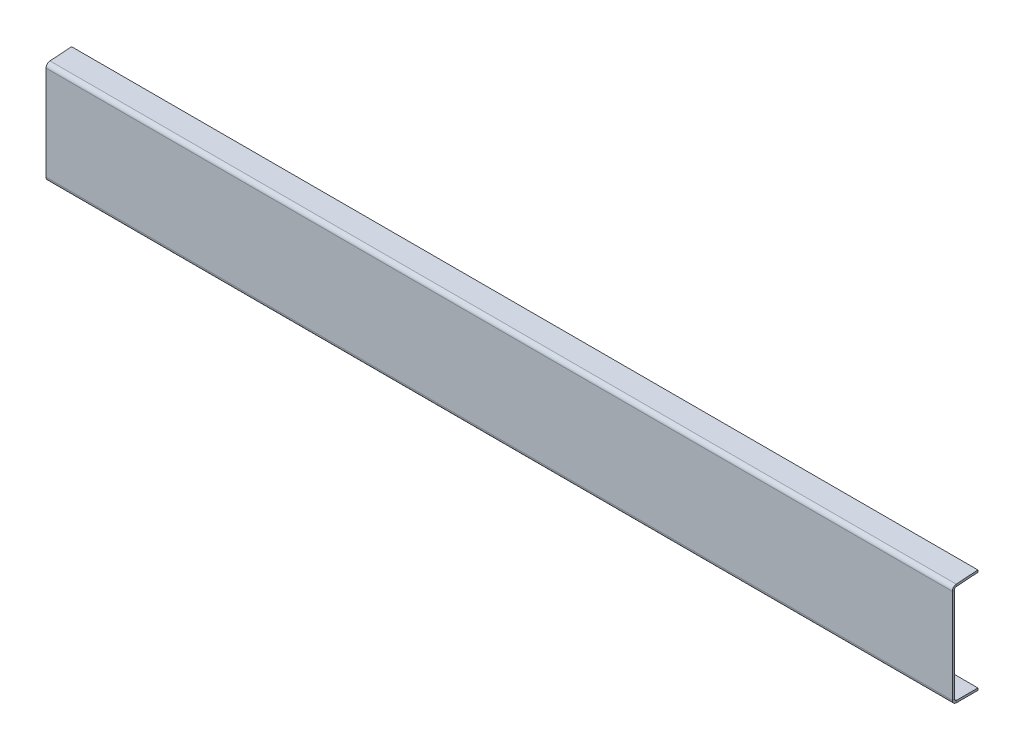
ISO-10303-21;
HEADER;
FILE_DESCRIPTION(('STEP AP214'),'2;1');
FILE_NAME('part.step','',(''),(''),'','','');
FILE_SCHEMA(('AUTOMOTIVE_DESIGN { 1 0 10303 214 1 1 1 1 }'));
ENDSEC;
DATA;
#1=APPLICATION_CONTEXT('core data for automotive mechanical design processes');
#2=APPLICATION_PROTOCOL_DEFINITION('international standard','automotive_design',2000,#1);
#3=PRODUCT_CONTEXT('',#1,'mechanical');
#4=PRODUCT('Part','Part','',(#3));
#5=PRODUCT_RELATED_PRODUCT_CATEGORY('part','',(#4));
#6=PRODUCT_DEFINITION_FORMATION('','',#4);
#7=PRODUCT_DEFINITION_CONTEXT('part definition',#1,'design');
#8=PRODUCT_DEFINITION('design','',#6,#7);
#9=PRODUCT_DEFINITION_SHAPE('','',#8);
#10=(LENGTH_UNIT() NAMED_UNIT(*) SI_UNIT(.MILLI.,.METRE.));
#11=(NAMED_UNIT(*) PLANE_ANGLE_UNIT() SI_UNIT($,.RADIAN.));
#12=(NAMED_UNIT(*) SI_UNIT($,.STERADIAN.) SOLID_ANGLE_UNIT());
#13=UNCERTAINTY_MEASURE_WITH_UNIT(LENGTH_MEASURE(1.E-05),#10,'distance_accuracy_value','');
#14=(GEOMETRIC_REPRESENTATION_CONTEXT(3) GLOBAL_UNCERTAINTY_ASSIGNED_CONTEXT((#13)) GLOBAL_UNIT_ASSIGNED_CONTEXT((#10,
#11,#12)) REPRESENTATION_CONTEXT('',''));
#15=CARTESIAN_POINT('',(0.,0.,0.));
#16=DIRECTION('',(0.,0.,1.));
#17=DIRECTION('',(1.,0.,0.));
#18=AXIS2_PLACEMENT_3D('',#15,#16,#17);
#19=CARTESIAN_POINT('',(2692.4,12.6999999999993,7.99360577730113E-12));
#20=DIRECTION('',(1.,0.,0.));
#21=DIRECTION('',(0.,0.,-0.999999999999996));
#22=AXIS2_PLACEMENT_3D('',#19,#20,#21);
#23=PLANE('',#22);
#24=DIRECTION('',(0.,0.,-0.999999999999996));
#25=VECTOR('',#24,1.);
#26=CARTESIAN_POINT('',(2692.4,12.6999999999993,7.99360577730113E-12));
#27=LINE('',#26,#25);
#28=CARTESIAN_POINT('',(2692.4,12.6999999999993,7.99360577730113E-12));
#29=VERTEX_POINT('',#28);
#30=CARTESIAN_POINT('',(2692.4,12.6999999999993,-6.34999999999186));
#31=VERTEX_POINT('',#30);
#32=EDGE_CURVE('E11',#29,#31,#27,.T.);
#33=ORIENTED_EDGE('',*,*,#32,.F.);
#34=CARTESIAN_POINT('',(2692.4,12.6999999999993,-12.6999999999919));
#35=DIRECTION('',(1.,0.,0.));
#36=DIRECTION('',(0.,0.,-0.999999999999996));
#37=AXIS2_PLACEMENT_3D('',#34,#35,#36);
#38=CIRCLE('',#37,12.7);
#39=CARTESIAN_POINT('',(2692.4,-6.7028581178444E-13,-12.6999999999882));
#40=VERTEX_POINT('',#39);
#41=EDGE_CURVE('E246',#40,#29,#38,.F.);
#42=ORIENTED_EDGE('',*,*,#41,.F.);
#43=DIRECTION('',(0.,-1.,0.));
#44=VECTOR('',#43,1.);
#45=CARTESIAN_POINT('',(2692.4,6.34999999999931,-12.6999999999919));
#46=LINE('',#45,#44);
#47=CARTESIAN_POINT('',(2692.4,6.34999999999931,-12.6999999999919));
#48=VERTEX_POINT('',#47);
#49=EDGE_CURVE('E44',#48,#40,#46,.T.);
#50=ORIENTED_EDGE('',*,*,#49,.F.);
#51=CARTESIAN_POINT('',(2692.4,12.6999999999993,-12.6999999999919));
#52=DIRECTION('',(1.,0.,0.));
#53=DIRECTION('',(0.,0.,-0.999999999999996));
#54=AXIS2_PLACEMENT_3D('',#51,#52,#53);
#55=CIRCLE('',#54,6.35);
#56=EDGE_CURVE('E145',#48,#31,#55,.F.);
#57=ORIENTED_EDGE('',*,*,#56,.T.);
#58=EDGE_LOOP('',(#33,#42,#50,#57));
#59=FACE_BOUND('',#58,.T.);
#60=ADVANCED_FACE('F36',(#59),#23,.T.);
#61=CARTESIAN_POINT('',(2692.4,6.34999999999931,-12.6999999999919));
#62=DIRECTION('',(1.,0.,0.));
#63=DIRECTION('',(0.,0.,-0.999999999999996));
#64=AXIS2_PLACEMENT_3D('',#61,#62,#63);
#65=PLANE('',#64);
#66=DIRECTION('',(0.,1.,0.));
#67=VECTOR('',#66,1.);
#68=CARTESIAN_POINT('',(2692.4,-6.72562006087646E-13,1.19904086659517E-11));
#69=LINE('',#68,#67);
#70=CARTESIAN_POINT('',(2692.4,292.957058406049,7.99360577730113E-12));
#71=VERTEX_POINT('',#70);
#72=EDGE_CURVE('E139',#29,#71,#69,.T.);
#73=ORIENTED_EDGE('',*,*,#72,.F.);
#74=ORIENTED_EDGE('',*,*,#32,.T.);
#75=DIRECTION('',(0.,1.,0.));
#76=VECTOR('',#75,1.);
#77=CARTESIAN_POINT('',(2692.4,-6.71768890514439E-13,-6.34999999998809));
#78=LINE('',#77,#76);
#79=CARTESIAN_POINT('',(2692.4,292.957058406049,-6.34999999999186));
#80=VERTEX_POINT('',#79);
#81=EDGE_CURVE('E136',#31,#80,#78,.T.);
#82=ORIENTED_EDGE('',*,*,#81,.T.);
#83=DIRECTION('',(0.,0.,0.999999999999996));
#84=VECTOR('',#83,1.);
#85=CARTESIAN_POINT('',(2692.4,292.957058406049,-6.34999999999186));
#86=LINE('',#85,#84);
#87=EDGE_CURVE('E227',#80,#71,#86,.T.);
#88=ORIENTED_EDGE('',*,*,#87,.T.);
#89=EDGE_LOOP('',(#73,#74,#82,#88));
#90=FACE_BOUND('',#89,.T.);
#91=ADVANCED_FACE('F134',(#90),#65,.T.);
#92=CARTESIAN_POINT('',(0.,0.,-12.7000000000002));
#93=DIRECTION('',(-1.,0.,0.));
#94=DIRECTION('',(0.,0.,0.999999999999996));
#95=AXIS2_PLACEMENT_3D('',#92,#93,#94);
#96=PLANE('',#95);
#97=DIRECTION('',(0.,1.,0.));
#98=VECTOR('',#97,1.);
#99=CARTESIAN_POINT('',(0.,0.,-12.7000000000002));
#100=LINE('',#99,#98);
#101=CARTESIAN_POINT('',(0.,0.,-12.7000000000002));
#102=VERTEX_POINT('',#101);
#103=CARTESIAN_POINT('',(0.,6.34999999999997,-12.7000000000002));
#104=VERTEX_POINT('',#103);
#105=EDGE_CURVE('E232',#102,#104,#100,.T.);
#106=ORIENTED_EDGE('',*,*,#105,.F.);
#107=CARTESIAN_POINT('',(0.,12.7,-12.7000000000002));
#108=DIRECTION('',(1.,0.,0.));
#109=DIRECTION('',(0.,0.,-0.999999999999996));
#110=AXIS2_PLACEMENT_3D('',#107,#108,#109);
#111=CIRCLE('',#110,12.7);
#112=CARTESIAN_POINT('',(0.,12.7,0.));
#113=VERTEX_POINT('',#112);
#114=EDGE_CURVE('E184',#102,#113,#111,.F.);
#115=ORIENTED_EDGE('',*,*,#114,.T.);
#116=DIRECTION('',(0.,0.,0.999999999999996));
#117=VECTOR('',#116,1.);
#118=CARTESIAN_POINT('',(0.,12.7,-6.35000000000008));
#119=LINE('',#118,#117);
#120=CARTESIAN_POINT('',(0.,12.7,-6.35000000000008));
#121=VERTEX_POINT('',#120);
#122=EDGE_CURVE('E230',#121,#113,#119,.T.);
#123=ORIENTED_EDGE('',*,*,#122,.F.);
#124=CARTESIAN_POINT('',(0.,12.7,-12.7000000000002));
#125=DIRECTION('',(1.,0.,0.));
#126=DIRECTION('',(0.,0.,-0.999999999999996));
#127=AXIS2_PLACEMENT_3D('',#124,#125,#126);
#128=CIRCLE('',#127,6.35);
#129=EDGE_CURVE('E157',#104,#121,#128,.F.);
#130=ORIENTED_EDGE('',*,*,#129,.F.);
#131=EDGE_LOOP('',(#106,#115,#123,#130));
#132=FACE_BOUND('',#131,.T.);
#133=ADVANCED_FACE('F284',(#132),#96,.T.);
#134=CARTESIAN_POINT('',(0.,12.7,-6.35000000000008));
#135=DIRECTION('',(-1.,0.,0.));
#136=DIRECTION('',(0.,0.,0.999999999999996));
#137=AXIS2_PLACEMENT_3D('',#134,#135,#136);
#138=PLANE('',#137);
#139=DIRECTION('',(0.,0.,0.999999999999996));
#140=VECTOR('',#139,1.);
#141=CARTESIAN_POINT('',(0.,0.,-76.2));
#142=LINE('',#141,#140);
#143=CARTESIAN_POINT('',(0.,0.,-76.2));
#144=VERTEX_POINT('',#143);
#145=EDGE_CURVE('E187',#144,#102,#142,.T.);
#146=ORIENTED_EDGE('',*,*,#145,.T.);
#147=ORIENTED_EDGE('',*,*,#105,.T.);
#148=DIRECTION('',(0.,0.,0.999999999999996));
#149=VECTOR('',#148,1.);
#150=CARTESIAN_POINT('',(0.,6.35,-76.2));
#151=LINE('',#150,#149);
#152=CARTESIAN_POINT('',(0.,6.35,-76.2));
#153=VERTEX_POINT('',#152);
#154=EDGE_CURVE('E193',#153,#104,#151,.T.);
#155=ORIENTED_EDGE('',*,*,#154,.F.);
#156=DIRECTION('',(0.,-1.,0.));
#157=VECTOR('',#156,1.);
#158=CARTESIAN_POINT('',(0.,6.35,-76.2));
#159=LINE('',#158,#157);
#160=EDGE_CURVE('E190',#153,#144,#159,.T.);
#161=ORIENTED_EDGE('',*,*,#160,.T.);
#162=EDGE_LOOP('',(#146,#147,#155,#161));
#163=FACE_BOUND('',#162,.T.);
#164=ADVANCED_FACE('F287',(#163),#138,.T.);
#165=CARTESIAN_POINT('',(2692.4,305.626121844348,-11.8140927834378));
#166=DIRECTION('',(1.,0.,0.));
#167=DIRECTION('',(0.,0.,-0.999999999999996));
#168=AXIS2_PLACEMENT_3D('',#165,#166,#167);
#169=PLANE('',#168);
#170=DIRECTION('',(0.,-0.997564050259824,-0.0697564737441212));
#171=VECTOR('',#170,1.);
#172=CARTESIAN_POINT('',(2692.4,305.626121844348,-11.8140927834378));
#173=LINE('',#172,#171);
#174=CARTESIAN_POINT('',(2692.4,305.626121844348,-11.8140927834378));
#175=VERTEX_POINT('',#174);
#176=CARTESIAN_POINT('',(2692.4,299.291590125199,-12.2570463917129));
#177=VERTEX_POINT('',#176);
#178=EDGE_CURVE('E52',#175,#177,#173,.T.);
#179=ORIENTED_EDGE('',*,*,#178,.F.);
#180=CARTESIAN_POINT('',(2692.4,292.95705840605,-12.6999999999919));
#181=DIRECTION('',(1.,0.,0.));
#182=DIRECTION('',(0.,0.,-0.999999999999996));
#183=AXIS2_PLACEMENT_3D('',#180,#181,#182);
#184=CIRCLE('',#183,12.7);
#185=EDGE_CURVE('E256',#71,#175,#184,.F.);
#186=ORIENTED_EDGE('',*,*,#185,.F.);
#187=ORIENTED_EDGE('',*,*,#87,.F.);
#188=CARTESIAN_POINT('',(2692.4,292.95705840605,-12.6999999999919));
#189=DIRECTION('',(1.,0.,0.));
#190=DIRECTION('',(0.,0.,-0.999999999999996));
#191=AXIS2_PLACEMENT_3D('',#188,#189,#190);
#192=CIRCLE('',#191,6.35);
#193=EDGE_CURVE('E165',#80,#177,#192,.F.);
#194=ORIENTED_EDGE('',*,*,#193,.T.);
#195=EDGE_LOOP('',(#179,#186,#187,#194));
#196=FACE_BOUND('',#195,.T.);
#197=ADVANCED_FACE('F279',(#196),#169,.T.);
#198=CARTESIAN_POINT('',(2692.4,292.957058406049,-6.34999999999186));
#199=DIRECTION('',(1.,0.,0.));
#200=DIRECTION('',(0.,0.,-0.999999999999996));
#201=AXIS2_PLACEMENT_3D('',#198,#199,#200);
#202=PLANE('',#201);
#203=DIRECTION('',(0.,0.0697564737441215,-0.997564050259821));
#204=VECTOR('',#203,1.);
#205=CARTESIAN_POINT('',(2692.4,304.799999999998,1.19904086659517E-11));
#206=LINE('',#205,#204);
#207=CARTESIAN_POINT('',(2692.4,310.115443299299,-76.0143806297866));
#208=VERTEX_POINT('',#207);
#209=EDGE_CURVE('E259',#175,#208,#206,.T.);
#210=ORIENTED_EDGE('',*,*,#209,.F.);
#211=ORIENTED_EDGE('',*,*,#178,.T.);
#212=DIRECTION('',(0.,0.0697564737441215,-0.997564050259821));
#213=VECTOR('',#212,1.);
#214=CARTESIAN_POINT('',(2692.4,298.465468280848,-0.442953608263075));
#215=LINE('',#214,#213);
#216=CARTESIAN_POINT('',(2692.4,303.78091158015,-76.4573342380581));
#217=VERTEX_POINT('',#216);
#218=EDGE_CURVE('E106',#177,#217,#215,.T.);
#219=ORIENTED_EDGE('',*,*,#218,.T.);
#220=DIRECTION('',(0.,-0.997564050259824,-0.0697564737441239));
#221=VECTOR('',#220,1.);
#222=CARTESIAN_POINT('',(2692.4,310.115443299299,-76.0143806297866));
#223=LINE('',#222,#221);
#224=EDGE_CURVE('E262',#208,#217,#223,.T.);
#225=ORIENTED_EDGE('',*,*,#224,.F.);
#226=EDGE_LOOP('',(#210,#211,#219,#225));
#227=FACE_BOUND('',#226,.T.);
#228=ADVANCED_FACE('F268',(#227),#202,.T.);
#229=CARTESIAN_POINT('',(0.,292.957058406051,0.));
#230=DIRECTION('',(-1.,0.,0.));
#231=DIRECTION('',(0.,0.,0.999999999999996));
#232=AXIS2_PLACEMENT_3D('',#229,#230,#231);
#233=PLANE('',#232);
#234=DIRECTION('',(0.,0.,-0.999999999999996));
#235=VECTOR('',#234,1.);
#236=CARTESIAN_POINT('',(0.,292.957058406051,0.));
#237=LINE('',#236,#235);
#238=CARTESIAN_POINT('',(0.,292.957058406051,0.));
#239=VERTEX_POINT('',#238);
#240=CARTESIAN_POINT('',(0.,292.957058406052,-6.35000000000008));
#241=VERTEX_POINT('',#240);
#242=EDGE_CURVE('E93',#239,#241,#237,.T.);
#243=ORIENTED_EDGE('',*,*,#242,.F.);
#244=CARTESIAN_POINT('',(0.,292.957058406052,-12.7000000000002));
#245=DIRECTION('',(1.,0.,0.));
#246=DIRECTION('',(0.,0.,-0.999999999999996));
#247=AXIS2_PLACEMENT_3D('',#244,#245,#246);
#248=CIRCLE('',#247,12.7);
#249=CARTESIAN_POINT('',(0.,305.62612184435,-11.8140927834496));
#250=VERTEX_POINT('',#249);
#251=EDGE_CURVE('E180',#239,#250,#248,.F.);
#252=ORIENTED_EDGE('',*,*,#251,.T.);
#253=DIRECTION('',(0.,0.997564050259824,0.0697564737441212));
#254=VECTOR('',#253,1.);
#255=CARTESIAN_POINT('',(0.,299.291590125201,-12.2570463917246));
#256=LINE('',#255,#254);
#257=CARTESIAN_POINT('',(0.,299.291590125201,-12.2570463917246));
#258=VERTEX_POINT('',#257);
#259=EDGE_CURVE('E100',#258,#250,#256,.T.);
#260=ORIENTED_EDGE('',*,*,#259,.F.);
#261=CARTESIAN_POINT('',(0.,292.957058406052,-12.7000000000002));
#262=DIRECTION('',(1.,0.,0.));
#263=DIRECTION('',(0.,0.,-0.999999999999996));
#264=AXIS2_PLACEMENT_3D('',#261,#262,#263);
#265=CIRCLE('',#264,6.35);
#266=EDGE_CURVE('E199',#241,#258,#265,.F.);
#267=ORIENTED_EDGE('',*,*,#266,.F.);
#268=EDGE_LOOP('',(#243,#252,#260,#267));
#269=FACE_BOUND('',#268,.T.);
#270=ADVANCED_FACE('F316',(#269),#233,.T.);
#271=CARTESIAN_POINT('',(0.,299.291590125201,-12.2570463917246));
#272=DIRECTION('',(-1.,0.,0.));
#273=DIRECTION('',(0.,0.,0.999999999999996));
#274=AXIS2_PLACEMENT_3D('',#271,#272,#273);
#275=PLANE('',#274);
#276=DIRECTION('',(0.,1.,0.));
#277=VECTOR('',#276,1.);
#278=CARTESIAN_POINT('',(0.,0.,0.));
#279=LINE('',#278,#277);
#280=EDGE_CURVE('E182',#113,#239,#279,.T.);
#281=ORIENTED_EDGE('',*,*,#280,.T.);
#282=ORIENTED_EDGE('',*,*,#242,.T.);
#283=DIRECTION('',(0.,1.,0.));
#284=VECTOR('',#283,1.);
#285=CARTESIAN_POINT('',(0.,0.,-6.35000000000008));
#286=LINE('',#285,#284);
#287=EDGE_CURVE('E197',#121,#241,#286,.T.);
#288=ORIENTED_EDGE('',*,*,#287,.F.);
#289=ORIENTED_EDGE('',*,*,#122,.T.);
#290=EDGE_LOOP('',(#281,#282,#288,#289));
#291=FACE_BOUND('',#290,.T.);
#292=ADVANCED_FACE('F319',(#291),#275,.T.);
#293=CARTESIAN_POINT('',(2692.4,298.465468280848,-0.442953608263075));
#294=DIRECTION('',(0.,0.997564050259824,0.069756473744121));
#295=DIRECTION('',(0.,-0.0697564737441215,0.997564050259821));
#296=AXIS2_PLACEMENT_3D('',#293,#294,#295);
#297=PLANE('',#296);
#298=DIRECTION('',(0.,0.0697564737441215,-0.997564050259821));
#299=VECTOR('',#298,1.);
#300=CARTESIAN_POINT('',(0.,298.46546828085,-0.442953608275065));
#301=LINE('',#300,#299);
#302=CARTESIAN_POINT('',(0.,303.780911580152,-76.4573342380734));
#303=VERTEX_POINT('',#302);
#304=EDGE_CURVE('E171',#258,#303,#301,.T.);
#305=ORIENTED_EDGE('',*,*,#304,.T.);
#306=DIRECTION('',(-1.,0.,0.));
#307=VECTOR('',#306,1.);
#308=CARTESIAN_POINT('',(2692.4,303.78091158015,-76.4573342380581));
#309=LINE('',#308,#307);
#310=EDGE_CURVE('E223',#217,#303,#309,.T.);
#311=ORIENTED_EDGE('',*,*,#310,.F.);
#312=ORIENTED_EDGE('',*,*,#218,.F.);
#313=DIRECTION('',(-1.,0.,0.));
#314=VECTOR('',#313,1.);
#315=CARTESIAN_POINT('',(2692.4,299.291590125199,-12.2570463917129));
#316=LINE('',#315,#314);
#317=EDGE_CURVE('E167',#177,#258,#316,.T.);
#318=ORIENTED_EDGE('',*,*,#317,.T.);
#319=EDGE_LOOP('',(#305,#311,#312,#318));
#320=FACE_BOUND('',#319,.T.);
#321=ADVANCED_FACE('F322',(#320),#297,.F.);
#322=CARTESIAN_POINT('',(2692.4,310.115443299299,-76.0143806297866));
#323=DIRECTION('',(0.,0.0697564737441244,-0.99756405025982));
#324=DIRECTION('',(0.,0.997564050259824,0.0697564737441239));
#325=AXIS2_PLACEMENT_3D('',#322,#323,#324);
#326=PLANE('',#325);
#327=DIRECTION('',(0.,-0.997564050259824,-0.0697564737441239));
#328=VECTOR('',#327,1.);
#329=CARTESIAN_POINT('',(0.,310.115443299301,-76.0143806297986));
#330=LINE('',#329,#328);
#331=CARTESIAN_POINT('',(0.,310.115443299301,-76.0143806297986));
#332=VERTEX_POINT('',#331);
#333=EDGE_CURVE('E174',#332,#303,#330,.T.);
#334=ORIENTED_EDGE('',*,*,#333,.F.);
#335=DIRECTION('',(-1.,0.,0.));
#336=VECTOR('',#335,1.);
#337=CARTESIAN_POINT('',(2692.4,310.115443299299,-76.0143806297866));
#338=LINE('',#337,#336);
#339=EDGE_CURVE('E221',#208,#332,#338,.T.);
#340=ORIENTED_EDGE('',*,*,#339,.F.);
#341=ORIENTED_EDGE('',*,*,#224,.T.);
#342=ORIENTED_EDGE('',*,*,#310,.T.);
#343=EDGE_LOOP('',(#334,#340,#341,#342));
#344=FACE_BOUND('',#343,.T.);
#345=ADVANCED_FACE('F267',(#344),#326,.T.);
#346=CARTESIAN_POINT('',(2692.4,304.799999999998,1.19904086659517E-11));
#347=DIRECTION('',(0.,0.997564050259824,0.069756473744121));
#348=DIRECTION('',(0.,-0.0697564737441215,0.997564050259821));
#349=AXIS2_PLACEMENT_3D('',#346,#347,#348);
#350=PLANE('',#349);
#351=DIRECTION('',(0.,0.0697564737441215,-0.997564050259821));
#352=VECTOR('',#351,1.);
#353=CARTESIAN_POINT('',(0.,304.8,0.));
#354=LINE('',#353,#352);
#355=EDGE_CURVE('E177',#250,#332,#354,.T.);
#356=ORIENTED_EDGE('',*,*,#355,.F.);
#357=DIRECTION('',(-1.,0.,0.));
#358=VECTOR('',#357,1.);
#359=CARTESIAN_POINT('',(2692.4,305.626121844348,-11.8140927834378));
#360=LINE('',#359,#358);
#361=EDGE_CURVE('E218',#175,#250,#360,.T.);
#362=ORIENTED_EDGE('',*,*,#361,.F.);
#363=ORIENTED_EDGE('',*,*,#209,.T.);
#364=ORIENTED_EDGE('',*,*,#339,.T.);
#365=EDGE_LOOP('',(#356,#362,#363,#364));
#366=FACE_BOUND('',#365,.T.);
#367=ADVANCED_FACE('F272',(#366),#350,.T.);
#368=CARTESIAN_POINT('',(2692.4,292.95705840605,-12.6999999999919));
#369=DIRECTION('',(-1.,0.,0.));
#370=DIRECTION('',(0.,0.,0.999999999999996));
#371=AXIS2_PLACEMENT_3D('',#368,#369,#370);
#372=CYLINDRICAL_SURFACE('',#371,12.7);
#373=ORIENTED_EDGE('',*,*,#251,.F.);
#374=DIRECTION('',(-1.,0.,0.));
#375=VECTOR('',#374,1.);
#376=CARTESIAN_POINT('',(2692.4,292.957058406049,7.99360577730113E-12));
#377=LINE('',#376,#375);
#378=EDGE_CURVE('E215',#71,#239,#377,.T.);
#379=ORIENTED_EDGE('',*,*,#378,.F.);
#380=ORIENTED_EDGE('',*,*,#185,.T.);
#381=ORIENTED_EDGE('',*,*,#361,.T.);
#382=EDGE_LOOP('',(#373,#379,#380,#381));
#383=FACE_BOUND('',#382,.T.);
#384=ADVANCED_FACE('F275',(#383),#372,.T.);
#385=CARTESIAN_POINT('',(2692.4,-6.72562006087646E-13,1.19904086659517E-11));
#386=DIRECTION('',(0.,0.,0.999999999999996));
#387=DIRECTION('',(1.,0.,0.));
#388=AXIS2_PLACEMENT_3D('',#385,#386,#387);
#389=PLANE('',#388);
#390=ORIENTED_EDGE('',*,*,#280,.F.);
#391=DIRECTION('',(-1.,0.,0.));
#392=VECTOR('',#391,1.);
#393=CARTESIAN_POINT('',(2692.4,12.6999999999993,7.99360577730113E-12));
#394=LINE('',#393,#392);
#395=EDGE_CURVE('E212',#29,#113,#394,.T.);
#396=ORIENTED_EDGE('',*,*,#395,.F.);
#397=ORIENTED_EDGE('',*,*,#72,.T.);
#398=ORIENTED_EDGE('',*,*,#378,.T.);
#399=EDGE_LOOP('',(#390,#396,#397,#398));
#400=FACE_BOUND('',#399,.T.);
#401=ADVANCED_FACE('F282',(#400),#389,.T.);
#402=CARTESIAN_POINT('',(2692.4,12.6999999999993,-12.6999999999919));
#403=DIRECTION('',(-1.,0.,0.));
#404=DIRECTION('',(0.,0.,0.999999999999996));
#405=AXIS2_PLACEMENT_3D('',#402,#403,#404);
#406=CYLINDRICAL_SURFACE('',#405,12.7);
#407=ORIENTED_EDGE('',*,*,#114,.F.);
#408=DIRECTION('',(-1.,0.,0.));
#409=VECTOR('',#408,1.);
#410=CARTESIAN_POINT('',(2692.4,-6.7028581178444E-13,-12.6999999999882));
#411=LINE('',#410,#409);
#412=EDGE_CURVE('E209',#40,#102,#411,.T.);
#413=ORIENTED_EDGE('',*,*,#412,.F.);
#414=ORIENTED_EDGE('',*,*,#41,.T.);
#415=ORIENTED_EDGE('',*,*,#395,.T.);
#416=EDGE_LOOP('',(#407,#413,#414,#415));
#417=FACE_BOUND('',#416,.T.);
#418=ADVANCED_FACE('F245',(#417),#406,.T.);
#419=CARTESIAN_POINT('',(2692.4,-6.58904840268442E-13,-76.1999999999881));
#420=DIRECTION('',(0.,-1.,0.));
#421=DIRECTION('',(0.,0.,-0.999999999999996));
#422=AXIS2_PLACEMENT_3D('',#419,#420,#421);
#423=PLANE('',#422);
#424=ORIENTED_EDGE('',*,*,#145,.F.);
#425=DIRECTION('',(-1.,0.,0.));
#426=VECTOR('',#425,1.);
#427=CARTESIAN_POINT('',(2692.4,-6.58904840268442E-13,-76.1999999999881));
#428=LINE('',#427,#426);
#429=CARTESIAN_POINT('',(2692.4,-6.58904840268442E-13,-76.1999999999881));
#430=VERTEX_POINT('',#429);
#431=EDGE_CURVE('E207',#430,#144,#428,.T.);
#432=ORIENTED_EDGE('',*,*,#431,.F.);
#433=DIRECTION('',(0.,0.,0.999999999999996));
#434=VECTOR('',#433,1.);
#435=CARTESIAN_POINT('',(2692.4,-6.58904840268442E-13,-76.1999999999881));
#436=LINE('',#435,#434);
#437=EDGE_CURVE('E239',#430,#40,#436,.T.);
#438=ORIENTED_EDGE('',*,*,#437,.T.);
#439=ORIENTED_EDGE('',*,*,#412,.T.);
#440=EDGE_LOOP('',(#424,#432,#438,#439));
#441=FACE_BOUND('',#440,.T.);
#442=ADVANCED_FACE('F250',(#441),#423,.T.);
#443=CARTESIAN_POINT('',(2692.4,6.34999999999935,-76.1999999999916));
#444=DIRECTION('',(0.,0.,-0.999999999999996));
#445=DIRECTION('',(-1.,0.,0.));
#446=AXIS2_PLACEMENT_3D('',#443,#444,#445);
#447=PLANE('',#446);
#448=ORIENTED_EDGE('',*,*,#160,.F.);
#449=DIRECTION('',(-1.,0.,0.));
#450=VECTOR('',#449,1.);
#451=CARTESIAN_POINT('',(2692.4,6.34999999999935,-76.1999999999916));
#452=LINE('',#451,#450);
#453=CARTESIAN_POINT('',(2692.4,6.34999999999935,-76.1999999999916));
#454=VERTEX_POINT('',#453);
#455=EDGE_CURVE('E205',#454,#153,#452,.T.);
#456=ORIENTED_EDGE('',*,*,#455,.F.);
#457=DIRECTION('',(0.,-1.,0.));
#458=VECTOR('',#457,1.);
#459=CARTESIAN_POINT('',(2692.4,6.34999999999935,-76.1999999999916));
#460=LINE('',#459,#458);
#461=EDGE_CURVE('E251',#454,#430,#460,.T.);
#462=ORIENTED_EDGE('',*,*,#461,.T.);
#463=ORIENTED_EDGE('',*,*,#431,.T.);
#464=EDGE_LOOP('',(#448,#456,#462,#463));
#465=FACE_BOUND('',#464,.T.);
#466=ADVANCED_FACE('F292',(#465),#447,.T.);
#467=CARTESIAN_POINT('',(2692.4,6.34999999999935,-76.1999999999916));
#468=DIRECTION('',(0.,-1.,0.));
#469=DIRECTION('',(0.,0.,-0.999999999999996));
#470=AXIS2_PLACEMENT_3D('',#467,#468,#469);
#471=PLANE('',#470);
#472=ORIENTED_EDGE('',*,*,#154,.T.);
#473=DIRECTION('',(-1.,0.,0.));
#474=VECTOR('',#473,1.);
#475=CARTESIAN_POINT('',(2692.4,6.34999999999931,-12.6999999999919));
#476=LINE('',#475,#474);
#477=EDGE_CURVE('E159',#48,#104,#476,.T.);
#478=ORIENTED_EDGE('',*,*,#477,.F.);
#479=DIRECTION('',(0.,0.,0.999999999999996));
#480=VECTOR('',#479,1.);
#481=CARTESIAN_POINT('',(2692.4,6.34999999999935,-76.1999999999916));
#482=LINE('',#481,#480);
#483=EDGE_CURVE('E150',#454,#48,#482,.T.);
#484=ORIENTED_EDGE('',*,*,#483,.F.);
#485=ORIENTED_EDGE('',*,*,#455,.T.);
#486=EDGE_LOOP('',(#472,#478,#484,#485));
#487=FACE_BOUND('',#486,.T.);
#488=ADVANCED_FACE('F290',(#487),#471,.F.);
#489=CARTESIAN_POINT('',(2692.4,12.6999999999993,-12.6999999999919));
#490=DIRECTION('',(-1.,0.,0.));
#491=DIRECTION('',(0.,0.,0.999999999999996));
#492=AXIS2_PLACEMENT_3D('',#489,#490,#491);
#493=CYLINDRICAL_SURFACE('',#492,6.35);
#494=ORIENTED_EDGE('',*,*,#129,.T.);
#495=DIRECTION('',(-1.,0.,0.));
#496=VECTOR('',#495,1.);
#497=CARTESIAN_POINT('',(2692.4,12.6999999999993,-6.34999999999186));
#498=LINE('',#497,#496);
#499=EDGE_CURVE('E154',#31,#121,#498,.T.);
#500=ORIENTED_EDGE('',*,*,#499,.F.);
#501=ORIENTED_EDGE('',*,*,#56,.F.);
#502=ORIENTED_EDGE('',*,*,#477,.T.);
#503=EDGE_LOOP('',(#494,#500,#501,#502));
#504=FACE_BOUND('',#503,.T.);
#505=ADVANCED_FACE('F155',(#504),#493,.F.);
#506=CARTESIAN_POINT('',(2692.4,-6.71768890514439E-13,-6.34999999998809));
#507=DIRECTION('',(0.,0.,0.999999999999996));
#508=DIRECTION('',(1.,0.,0.));
#509=AXIS2_PLACEMENT_3D('',#506,#507,#508);
#510=PLANE('',#509);
#511=ORIENTED_EDGE('',*,*,#287,.T.);
#512=DIRECTION('',(-1.,0.,0.));
#513=VECTOR('',#512,1.);
#514=CARTESIAN_POINT('',(2692.4,292.957058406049,-6.34999999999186));
#515=LINE('',#514,#513);
#516=EDGE_CURVE('E160',#80,#241,#515,.T.);
#517=ORIENTED_EDGE('',*,*,#516,.F.);
#518=ORIENTED_EDGE('',*,*,#81,.F.);
#519=ORIENTED_EDGE('',*,*,#499,.T.);
#520=EDGE_LOOP('',(#511,#517,#518,#519));
#521=FACE_BOUND('',#520,.T.);
#522=ADVANCED_FACE('F162',(#521),#510,.F.);
#523=CARTESIAN_POINT('',(2692.4,292.95705840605,-12.6999999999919));
#524=DIRECTION('',(-1.,0.,0.));
#525=DIRECTION('',(0.,0.,0.999999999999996));
#526=AXIS2_PLACEMENT_3D('',#523,#524,#525);
#527=CYLINDRICAL_SURFACE('',#526,6.35);
#528=ORIENTED_EDGE('',*,*,#266,.T.);
#529=ORIENTED_EDGE('',*,*,#317,.F.);
#530=ORIENTED_EDGE('',*,*,#193,.F.);
#531=ORIENTED_EDGE('',*,*,#516,.T.);
#532=EDGE_LOOP('',(#528,#529,#530,#531));
#533=FACE_BOUND('',#532,.T.);
#534=ADVANCED_FACE('F374',(#533),#527,.F.);
#535=CARTESIAN_POINT('',(2692.4,292.95705840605,-12.6999999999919));
#536=DIRECTION('',(1.,0.,0.));
#537=DIRECTION('',(0.,0.,-0.999999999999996));
#538=AXIS2_PLACEMENT_3D('',#535,#536,#537);
#539=PLANE('',#538);
#540=ORIENTED_EDGE('',*,*,#483,.T.);
#541=ORIENTED_EDGE('',*,*,#49,.T.);
#542=ORIENTED_EDGE('',*,*,#437,.F.);
#543=ORIENTED_EDGE('',*,*,#461,.F.);
#544=EDGE_LOOP('',(#540,#541,#542,#543));
#545=FACE_BOUND('',#544,.T.);
#546=ADVANCED_FACE('F236',(#545),#539,.T.);
#547=CARTESIAN_POINT('',(0.,292.957058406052,-12.7000000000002));
#548=DIRECTION('',(1.,0.,0.));
#549=DIRECTION('',(0.,0.,-0.999999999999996));
#550=AXIS2_PLACEMENT_3D('',#547,#548,#549);
#551=PLANE('',#550);
#552=ORIENTED_EDGE('',*,*,#304,.F.);
#553=ORIENTED_EDGE('',*,*,#259,.T.);
#554=ORIENTED_EDGE('',*,*,#355,.T.);
#555=ORIENTED_EDGE('',*,*,#333,.T.);
#556=EDGE_LOOP('',(#552,#553,#554,#555));
#557=FACE_BOUND('',#556,.T.);
#558=ADVANCED_FACE('F394',(#557),#551,.F.);
#559=CLOSED_SHELL('',(#60,#91,#133,#164,#197,#228,#270,#292,#321,#345,#367,#384,#401,#418,#442,
#466,#488,#505,#522,#534,#546,#558));
#560=MANIFOLD_SOLID_BREP('B2',#559);
#561=ADVANCED_BREP_SHAPE_REPRESENTATION('',(#18,#560),#14);
#562=SHAPE_DEFINITION_REPRESENTATION(#9,#561);
ENDSEC;
END-ISO-10303-21;
